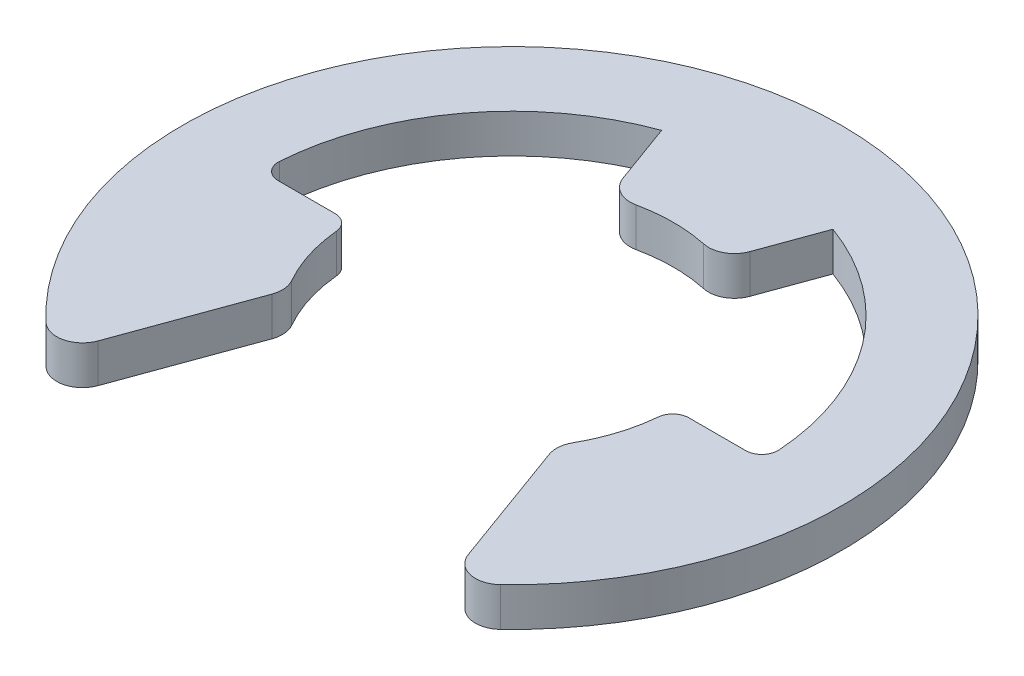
ISO-10303-21;
HEADER;
FILE_DESCRIPTION(('STEP AP214'),'2;1');
FILE_NAME('part.step','',(''),(''),'','','');
FILE_SCHEMA(('AUTOMOTIVE_DESIGN { 1 0 10303 214 1 1 1 1 }'));
ENDSEC;
DATA;
#1=APPLICATION_CONTEXT('core data for automotive mechanical design processes');
#2=APPLICATION_PROTOCOL_DEFINITION('international standard','automotive_design',2000,#1);
#3=PRODUCT_CONTEXT('',#1,'mechanical');
#4=PRODUCT('Part','Part','',(#3));
#5=PRODUCT_RELATED_PRODUCT_CATEGORY('part','',(#4));
#6=PRODUCT_DEFINITION_FORMATION('','',#4);
#7=PRODUCT_DEFINITION_CONTEXT('part definition',#1,'design');
#8=PRODUCT_DEFINITION('design','',#6,#7);
#9=PRODUCT_DEFINITION_SHAPE('','',#8);
#10=(LENGTH_UNIT() NAMED_UNIT(*) SI_UNIT(.MILLI.,.METRE.));
#11=(NAMED_UNIT(*) PLANE_ANGLE_UNIT() SI_UNIT($,.RADIAN.));
#12=(NAMED_UNIT(*) SI_UNIT($,.STERADIAN.) SOLID_ANGLE_UNIT());
#13=UNCERTAINTY_MEASURE_WITH_UNIT(LENGTH_MEASURE(1.E-05),#10,'distance_accuracy_value','');
#14=(GEOMETRIC_REPRESENTATION_CONTEXT(3) GLOBAL_UNCERTAINTY_ASSIGNED_CONTEXT((#13)) GLOBAL_UNIT_ASSIGNED_CONTEXT((#10,
#11,#12)) REPRESENTATION_CONTEXT('',''));
#15=CARTESIAN_POINT('',(0.,0.,0.));
#16=DIRECTION('',(0.,0.,1.));
#17=DIRECTION('',(1.,0.,0.));
#18=AXIS2_PLACEMENT_3D('',#15,#16,#17);
#19=CARTESIAN_POINT('',(0.,0.6,0.));
#20=DIRECTION('',(0.,-1.,0.));
#21=DIRECTION('',(0.,0.,-1.));
#22=AXIS2_PLACEMENT_3D('',#19,#20,#21);
#23=CYLINDRICAL_SURFACE('',#22,7.75);
#24=CARTESIAN_POINT('',(0.,0.6,0.));
#25=DIRECTION('',(0.,-1.,0.));
#26=DIRECTION('',(0.,0.,1.));
#27=AXIS2_PLACEMENT_3D('',#24,#25,#26);
#28=CIRCLE('',#27,7.75);
#29=CARTESIAN_POINT('',(-7.73154759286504,0.6,-0.53448275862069));
#30=VERTEX_POINT('',#29);
#31=CARTESIAN_POINT('',(-2.65065611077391,0.6,-7.2826178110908));
#32=VERTEX_POINT('',#31);
#33=EDGE_CURVE('E187',#30,#32,#28,.T.);
#34=ORIENTED_EDGE('',*,*,#33,.F.);
#35=DIRECTION('',(0.,-1.,0.));
#36=VECTOR('',#35,1.);
#37=CARTESIAN_POINT('',(-7.73154759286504,0.6,-0.53448275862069));
#38=LINE('',#37,#36);
#39=CARTESIAN_POINT('',(-7.73154759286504,-0.6,-0.53448275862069));
#40=VERTEX_POINT('',#39);
#41=EDGE_CURVE('E329',#30,#40,#38,.T.);
#42=ORIENTED_EDGE('',*,*,#41,.T.);
#43=CARTESIAN_POINT('',(0.,-0.6,0.));
#44=DIRECTION('',(0.,-1.,0.));
#45=DIRECTION('',(0.,0.,1.));
#46=AXIS2_PLACEMENT_3D('',#43,#44,#45);
#47=CIRCLE('',#46,7.75);
#48=CARTESIAN_POINT('',(-2.65065611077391,-0.6,-7.2826178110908));
#49=VERTEX_POINT('',#48);
#50=EDGE_CURVE('E211',#40,#49,#47,.T.);
#51=ORIENTED_EDGE('',*,*,#50,.T.);
#52=DIRECTION('',(0.,-1.,0.));
#53=VECTOR('',#52,1.);
#54=CARTESIAN_POINT('',(-2.65065611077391,0.6,-7.2826178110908));
#55=LINE('',#54,#53);
#56=EDGE_CURVE('E204',#32,#49,#55,.T.);
#57=ORIENTED_EDGE('',*,*,#56,.F.);
#58=EDGE_LOOP('',(#34,#42,#51,#57));
#59=FACE_BOUND('',#58,.T.);
#60=ADVANCED_FACE('F39',(#59),#23,.F.);
#61=CARTESIAN_POINT('',(-2.65065611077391,0.6,-7.2826178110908));
#62=DIRECTION('',(0.939692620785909,0.,-0.342020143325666));
#63=DIRECTION('',(-0.342020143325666,0.,-0.939692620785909));
#64=AXIS2_PLACEMENT_3D('',#61,#62,#63);
#65=PLANE('',#64);
#66=DIRECTION('',(0.342020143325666,0.,0.939692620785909));
#67=VECTOR('',#66,1.);
#68=CARTESIAN_POINT('',(-2.65065611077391,-0.6,-7.2826178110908));
#69=LINE('',#68,#67);
#70=CARTESIAN_POINT('',(-1.9647561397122,-0.6,-5.39812312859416));
#71=VERTEX_POINT('',#70);
#72=EDGE_CURVE('E448',#49,#71,#69,.T.);
#73=ORIENTED_EDGE('',*,*,#72,.T.);
#74=DIRECTION('',(0.,-1.,0.));
#75=VECTOR('',#74,1.);
#76=CARTESIAN_POINT('',(-1.9647561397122,0.6,-5.39812312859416));
#77=LINE('',#76,#75);
#78=CARTESIAN_POINT('',(-1.9647561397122,0.6,-5.39812312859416));
#79=VERTEX_POINT('',#78);
#80=EDGE_CURVE('E206',#71,#79,#77,.F.);
#81=ORIENTED_EDGE('',*,*,#80,.T.);
#82=DIRECTION('',(0.342020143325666,0.,0.939692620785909));
#83=VECTOR('',#82,1.);
#84=CARTESIAN_POINT('',(-2.65065611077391,0.6,-7.2826178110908));
#85=LINE('',#84,#83);
#86=EDGE_CURVE('E191',#32,#79,#85,.T.);
#87=ORIENTED_EDGE('',*,*,#86,.F.);
#88=ORIENTED_EDGE('',*,*,#56,.T.);
#89=EDGE_LOOP('',(#73,#81,#87,#88));
#90=FACE_BOUND('',#89,.T.);
#91=ADVANCED_FACE('F203',(#90),#65,.F.);
#92=CARTESIAN_POINT('',(0.,0.6,0.));
#93=DIRECTION('',(0.,-1.,0.));
#94=DIRECTION('',(0.,0.,-1.));
#95=AXIS2_PLACEMENT_3D('',#92,#93,#94);
#96=CYLINDRICAL_SURFACE('',#95,5.);
#97=CARTESIAN_POINT('',(0.,-0.6,0.));
#98=DIRECTION('',(0.,-1.,0.));
#99=DIRECTION('',(0.,0.,1.));
#100=AXIS2_PLACEMENT_3D('',#97,#98,#99);
#101=CIRCLE('',#100,5.);
#102=CARTESIAN_POINT('',(-1.04569141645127,-0.6,-4.88943038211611));
#103=VERTEX_POINT('',#102);
#104=CARTESIAN_POINT('',(1.04569141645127,-0.6,-4.88943038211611));
#105=VERTEX_POINT('',#104);
#106=EDGE_CURVE('E451',#103,#105,#101,.T.);
#107=ORIENTED_EDGE('',*,*,#106,.T.);
#108=DIRECTION('',(0.,-1.,0.));
#109=VECTOR('',#108,1.);
#110=CARTESIAN_POINT('',(1.04569141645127,0.6,-4.88943038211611));
#111=LINE('',#110,#109);
#112=CARTESIAN_POINT('',(1.04569141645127,0.6,-4.88943038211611));
#113=VERTEX_POINT('',#112);
#114=EDGE_CURVE('E291',#105,#113,#111,.F.);
#115=ORIENTED_EDGE('',*,*,#114,.T.);
#116=CARTESIAN_POINT('',(0.,0.6,0.));
#117=DIRECTION('',(0.,-1.,0.));
#118=DIRECTION('',(0.,0.,1.));
#119=AXIS2_PLACEMENT_3D('',#116,#117,#118);
#120=CIRCLE('',#119,5.);
#121=CARTESIAN_POINT('',(-1.04569141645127,0.6,-4.88943038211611));
#122=VERTEX_POINT('',#121);
#123=EDGE_CURVE('E208',#122,#113,#120,.T.);
#124=ORIENTED_EDGE('',*,*,#123,.F.);
#125=DIRECTION('',(0.,-1.,0.));
#126=VECTOR('',#125,1.);
#127=CARTESIAN_POINT('',(-1.04569141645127,0.6,-4.88943038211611));
#128=LINE('',#127,#126);
#129=EDGE_CURVE('E287',#122,#103,#128,.T.);
#130=ORIENTED_EDGE('',*,*,#129,.T.);
#131=EDGE_LOOP('',(#107,#115,#124,#130));
#132=FACE_BOUND('',#131,.T.);
#133=ADVANCED_FACE('F372',(#132),#96,.F.);
#134=CARTESIAN_POINT('',(1.71010071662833,0.6,-4.69846310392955));
#135=DIRECTION('',(-0.939692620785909,0.,-0.342020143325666));
#136=DIRECTION('',(-0.342020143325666,0.,0.939692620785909));
#137=AXIS2_PLACEMENT_3D('',#134,#135,#136);
#138=PLANE('',#137);
#139=DIRECTION('',(0.342020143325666,0.,-0.939692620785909));
#140=VECTOR('',#139,1.);
#141=CARTESIAN_POINT('',(1.71010071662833,0.6,-4.69846310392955));
#142=LINE('',#141,#140);
#143=CARTESIAN_POINT('',(1.9647561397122,0.6,-5.39812312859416));
#144=VERTEX_POINT('',#143);
#145=CARTESIAN_POINT('',(2.65065611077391,0.6,-7.2826178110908));
#146=VERTEX_POINT('',#145);
#147=EDGE_CURVE('E426',#144,#146,#142,.T.);
#148=ORIENTED_EDGE('',*,*,#147,.F.);
#149=DIRECTION('',(0.,-1.,0.));
#150=VECTOR('',#149,1.);
#151=CARTESIAN_POINT('',(1.9647561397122,0.6,-5.39812312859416));
#152=LINE('',#151,#150);
#153=CARTESIAN_POINT('',(1.9647561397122,-0.6,-5.39812312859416));
#154=VERTEX_POINT('',#153);
#155=EDGE_CURVE('E283',#144,#154,#152,.T.);
#156=ORIENTED_EDGE('',*,*,#155,.T.);
#157=DIRECTION('',(0.342020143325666,0.,-0.939692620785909));
#158=VECTOR('',#157,1.);
#159=CARTESIAN_POINT('',(1.71010071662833,-0.6,-4.69846310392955));
#160=LINE('',#159,#158);
#161=CARTESIAN_POINT('',(2.65065611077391,-0.6,-7.2826178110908));
#162=VERTEX_POINT('',#161);
#163=EDGE_CURVE('E455',#154,#162,#160,.T.);
#164=ORIENTED_EDGE('',*,*,#163,.T.);
#165=DIRECTION('',(0.,-1.,0.));
#166=VECTOR('',#165,1.);
#167=CARTESIAN_POINT('',(2.65065611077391,0.6,-7.2826178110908));
#168=LINE('',#167,#166);
#169=EDGE_CURVE('E215',#146,#162,#168,.T.);
#170=ORIENTED_EDGE('',*,*,#169,.F.);
#171=EDGE_LOOP('',(#148,#156,#164,#170));
#172=FACE_BOUND('',#171,.T.);
#173=ADVANCED_FACE('F527',(#172),#138,.F.);
#174=CARTESIAN_POINT('',(0.,0.6,0.));
#175=DIRECTION('',(0.,-1.,0.));
#176=DIRECTION('',(0.,0.,-1.));
#177=AXIS2_PLACEMENT_3D('',#174,#175,#176);
#178=CYLINDRICAL_SURFACE('',#177,7.75);
#179=CARTESIAN_POINT('',(0.,-0.6,0.));
#180=DIRECTION('',(0.,-1.,0.));
#181=DIRECTION('',(0.,0.,1.));
#182=AXIS2_PLACEMENT_3D('',#179,#180,#181);
#183=CIRCLE('',#182,7.75);
#184=CARTESIAN_POINT('',(7.73154759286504,-0.6,-0.53448275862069));
#185=VERTEX_POINT('',#184);
#186=EDGE_CURVE('E458',#162,#185,#183,.T.);
#187=ORIENTED_EDGE('',*,*,#186,.T.);
#188=DIRECTION('',(0.,-1.,0.));
#189=VECTOR('',#188,1.);
#190=CARTESIAN_POINT('',(7.73154759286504,0.6,-0.53448275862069));
#191=LINE('',#190,#189);
#192=CARTESIAN_POINT('',(7.73154759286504,0.6,-0.53448275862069));
#193=VERTEX_POINT('',#192);
#194=EDGE_CURVE('E310',#185,#193,#191,.F.);
#195=ORIENTED_EDGE('',*,*,#194,.T.);
#196=CARTESIAN_POINT('',(0.,0.6,0.));
#197=DIRECTION('',(0.,-1.,0.));
#198=DIRECTION('',(0.,0.,1.));
#199=AXIS2_PLACEMENT_3D('',#196,#197,#198);
#200=CIRCLE('',#199,7.75);
#201=EDGE_CURVE('E412',#146,#193,#200,.T.);
#202=ORIENTED_EDGE('',*,*,#201,.F.);
#203=ORIENTED_EDGE('',*,*,#169,.T.);
#204=EDGE_LOOP('',(#187,#195,#202,#203));
#205=FACE_BOUND('',#204,.T.);
#206=ADVANCED_FACE('F521',(#205),#178,.F.);
#207=CARTESIAN_POINT('',(5.,0.6,0.));
#208=DIRECTION('',(0.,0.,1.));
#209=DIRECTION('',(1.,0.,0.));
#210=AXIS2_PLACEMENT_3D('',#207,#208,#209);
#211=PLANE('',#210);
#212=DIRECTION('',(-1.,0.,0.));
#213=VECTOR('',#212,1.);
#214=CARTESIAN_POINT('',(5.,0.6,0.));
#215=LINE('',#214,#213);
#216=CARTESIAN_POINT('',(7.23273807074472,0.6,0.));
#217=VERTEX_POINT('',#216);
#218=CARTESIAN_POINT('',(5.47722557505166,0.6,0.));
#219=VERTEX_POINT('',#218);
#220=EDGE_CURVE('E409',#217,#219,#215,.T.);
#221=ORIENTED_EDGE('',*,*,#220,.F.);
#222=DIRECTION('',(0.,1.,0.));
#223=VECTOR('',#222,1.);
#224=CARTESIAN_POINT('',(7.23273807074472,-0.6,0.));
#225=LINE('',#224,#223);
#226=CARTESIAN_POINT('',(7.23273807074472,-0.6,0.));
#227=VERTEX_POINT('',#226);
#228=EDGE_CURVE('E306',#217,#227,#225,.F.);
#229=ORIENTED_EDGE('',*,*,#228,.T.);
#230=DIRECTION('',(-1.,0.,0.));
#231=VECTOR('',#230,1.);
#232=CARTESIAN_POINT('',(5.,-0.6,0.));
#233=LINE('',#232,#231);
#234=CARTESIAN_POINT('',(5.47722557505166,-0.6,0.));
#235=VERTEX_POINT('',#234);
#236=EDGE_CURVE('E462',#227,#235,#233,.T.);
#237=ORIENTED_EDGE('',*,*,#236,.T.);
#238=DIRECTION('',(0.,-1.,0.));
#239=VECTOR('',#238,1.);
#240=CARTESIAN_POINT('',(5.47722557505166,0.6,0.));
#241=LINE('',#240,#239);
#242=EDGE_CURVE('E303',#235,#219,#241,.F.);
#243=ORIENTED_EDGE('',*,*,#242,.T.);
#244=EDGE_LOOP('',(#221,#229,#237,#243));
#245=FACE_BOUND('',#244,.T.);
#246=ADVANCED_FACE('F414',(#245),#211,.F.);
#247=CARTESIAN_POINT('',(0.,0.6,0.));
#248=DIRECTION('',(0.,-1.,0.));
#249=DIRECTION('',(0.,0.,-1.));
#250=AXIS2_PLACEMENT_3D('',#247,#248,#249);
#251=CYLINDRICAL_SURFACE('',#250,5.);
#252=CARTESIAN_POINT('',(0.,0.6,0.));
#253=DIRECTION('',(0.,-1.,0.));
#254=DIRECTION('',(0.,0.,1.));
#255=AXIS2_PLACEMENT_3D('',#252,#253,#254);
#256=CIRCLE('',#255,5.);
#257=CARTESIAN_POINT('',(4.97929597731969,0.6,0.454545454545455));
#258=VERTEX_POINT('',#257);
#259=CARTESIAN_POINT('',(4.348203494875,0.6,2.46842588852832));
#260=VERTEX_POINT('',#259);
#261=EDGE_CURVE('E419',#258,#260,#256,.T.);
#262=ORIENTED_EDGE('',*,*,#261,.F.);
#263=DIRECTION('',(0.,-1.,0.));
#264=VECTOR('',#263,1.);
#265=CARTESIAN_POINT('',(4.97929597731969,0.6,0.454545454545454));
#266=LINE('',#265,#264);
#267=CARTESIAN_POINT('',(4.97929597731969,-0.6,0.454545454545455));
#268=VERTEX_POINT('',#267);
#269=EDGE_CURVE('E313',#258,#268,#266,.T.);
#270=ORIENTED_EDGE('',*,*,#269,.T.);
#271=CARTESIAN_POINT('',(0.,-0.6,0.));
#272=DIRECTION('',(0.,-1.,0.));
#273=DIRECTION('',(0.,0.,1.));
#274=AXIS2_PLACEMENT_3D('',#271,#272,#273);
#275=CIRCLE('',#274,5.);
#276=CARTESIAN_POINT('',(4.348203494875,-0.6,2.46842588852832));
#277=VERTEX_POINT('',#276);
#278=EDGE_CURVE('E464',#268,#277,#275,.T.);
#279=ORIENTED_EDGE('',*,*,#278,.T.);
#280=DIRECTION('',(0.,-1.,0.));
#281=VECTOR('',#280,1.);
#282=CARTESIAN_POINT('',(4.348203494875,0.6,2.46842588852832));
#283=LINE('',#282,#281);
#284=EDGE_CURVE('E250',#277,#260,#283,.F.);
#285=ORIENTED_EDGE('',*,*,#284,.T.);
#286=EDGE_LOOP('',(#262,#270,#279,#285));
#287=FACE_BOUND('',#286,.T.);
#288=ADVANCED_FACE('F512',(#287),#251,.F.);
#289=CARTESIAN_POINT('',(4.15999999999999,0.6,2.77387815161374));
#290=DIRECTION('',(0.939692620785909,0.,-0.342020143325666));
#291=DIRECTION('',(-0.342020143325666,0.,-0.939692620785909));
#292=AXIS2_PLACEMENT_3D('',#289,#290,#291);
#293=PLANE('',#292);
#294=DIRECTION('',(0.342020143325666,0.,0.939692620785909));
#295=VECTOR('',#294,1.);
#296=CARTESIAN_POINT('',(4.15999999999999,0.6,2.77387815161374));
#297=LINE('',#296,#295);
#298=CARTESIAN_POINT('',(4.29216195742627,0.6,3.13699014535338));
#299=VERTEX_POINT('',#298);
#300=CARTESIAN_POINT('',(5.72839201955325,0.6,7.0829998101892));
#301=VERTEX_POINT('',#300);
#302=EDGE_CURVE('E423',#299,#301,#297,.T.);
#303=ORIENTED_EDGE('',*,*,#302,.F.);
#304=DIRECTION('',(0.,-1.,0.));
#305=VECTOR('',#304,1.);
#306=CARTESIAN_POINT('',(4.29216195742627,0.6,3.13699014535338));
#307=LINE('',#306,#305);
#308=CARTESIAN_POINT('',(4.29216195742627,-0.6,3.13699014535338));
#309=VERTEX_POINT('',#308);
#310=EDGE_CURVE('E220',#299,#309,#307,.T.);
#311=ORIENTED_EDGE('',*,*,#310,.T.);
#312=DIRECTION('',(0.342020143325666,0.,0.939692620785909));
#313=VECTOR('',#312,1.);
#314=CARTESIAN_POINT('',(4.15999999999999,-0.6,2.77387815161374));
#315=LINE('',#314,#313);
#316=CARTESIAN_POINT('',(5.72839201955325,-0.6,7.0829998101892));
#317=VERTEX_POINT('',#316);
#318=EDGE_CURVE('E466',#309,#317,#315,.T.);
#319=ORIENTED_EDGE('',*,*,#318,.T.);
#320=DIRECTION('',(0.,-1.,0.));
#321=VECTOR('',#320,1.);
#322=CARTESIAN_POINT('',(5.72839201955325,0.6,7.0829998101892));
#323=LINE('',#322,#321);
#324=EDGE_CURVE('E214',#317,#301,#323,.F.);
#325=ORIENTED_EDGE('',*,*,#324,.T.);
#326=EDGE_LOOP('',(#303,#311,#319,#325));
#327=FACE_BOUND('',#326,.T.);
#328=ADVANCED_FACE('F506',(#327),#293,.F.);
#329=CARTESIAN_POINT('',(0.,0.6,0.));
#330=DIRECTION('',(0.,-1.,0.));
#331=DIRECTION('',(0.,0.,-1.));
#332=AXIS2_PLACEMENT_3D('',#329,#330,#331);
#333=CYLINDRICAL_SURFACE('',#332,10.2);
#334=CARTESIAN_POINT('',(0.,0.6,0.));
#335=DIRECTION('',(0.,1.,0.));
#336=DIRECTION('',(0.,0.,1.));
#337=AXIS2_PLACEMENT_3D('',#334,#335,#336);
#338=CIRCLE('',#337,10.2);
#339=CARTESIAN_POINT('',(7.03164791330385,0.6,7.3889057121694));
#340=VERTEX_POINT('',#339);
#341=CARTESIAN_POINT('',(-7.0316479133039,0.6,7.38890571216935));
#342=VERTEX_POINT('',#341);
#343=EDGE_CURVE('E433',#340,#342,#338,.T.);
#344=ORIENTED_EDGE('',*,*,#343,.F.);
#345=DIRECTION('',(0.,-1.,0.));
#346=VECTOR('',#345,1.);
#347=CARTESIAN_POINT('',(7.03164791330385,0.6,7.3889057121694));
#348=LINE('',#347,#346);
#349=CARTESIAN_POINT('',(7.03164791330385,-0.6,7.3889057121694));
#350=VERTEX_POINT('',#349);
#351=EDGE_CURVE('E299',#340,#350,#348,.T.);
#352=ORIENTED_EDGE('',*,*,#351,.T.);
#353=CARTESIAN_POINT('',(0.,-0.6,0.));
#354=DIRECTION('',(0.,1.,0.));
#355=DIRECTION('',(0.,0.,1.));
#356=AXIS2_PLACEMENT_3D('',#353,#354,#355);
#357=CIRCLE('',#356,10.2);
#358=CARTESIAN_POINT('',(-7.0316479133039,-0.6,7.38890571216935));
#359=VERTEX_POINT('',#358);
#360=EDGE_CURVE('E470',#350,#359,#357,.T.);
#361=ORIENTED_EDGE('',*,*,#360,.T.);
#362=DIRECTION('',(0.,-1.,0.));
#363=VECTOR('',#362,1.);
#364=CARTESIAN_POINT('',(-7.0316479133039,0.6,7.38890571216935));
#365=LINE('',#364,#363);
#366=EDGE_CURVE('E296',#359,#342,#365,.F.);
#367=ORIENTED_EDGE('',*,*,#366,.T.);
#368=EDGE_LOOP('',(#344,#352,#361,#367));
#369=FACE_BOUND('',#368,.T.);
#370=ADVANCED_FACE('F499',(#369),#333,.T.);
#371=CARTESIAN_POINT('',(-6.12030481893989,0.6,8.15977137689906));
#372=DIRECTION('',(-0.939692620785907,0.,-0.342020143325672));
#373=DIRECTION('',(-0.342020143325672,0.,0.939692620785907));
#374=AXIS2_PLACEMENT_3D('',#371,#372,#373);
#375=PLANE('',#374);
#376=DIRECTION('',(0.342020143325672,0.,-0.939692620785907));
#377=VECTOR('',#376,1.);
#378=CARTESIAN_POINT('',(-6.12030481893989,-0.6,8.15977137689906));
#379=LINE('',#378,#377);
#380=CARTESIAN_POINT('',(-5.7283920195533,-0.6,7.08299981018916));
#381=VERTEX_POINT('',#380);
#382=CARTESIAN_POINT('',(-4.2921619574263,-0.6,3.13699014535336));
#383=VERTEX_POINT('',#382);
#384=EDGE_CURVE('E474',#381,#383,#379,.T.);
#385=ORIENTED_EDGE('',*,*,#384,.T.);
#386=DIRECTION('',(0.,-1.,0.));
#387=VECTOR('',#386,1.);
#388=CARTESIAN_POINT('',(-4.2921619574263,0.6,3.13699014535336));
#389=LINE('',#388,#387);
#390=CARTESIAN_POINT('',(-4.2921619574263,0.6,3.13699014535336));
#391=VERTEX_POINT('',#390);
#392=EDGE_CURVE('E280',#383,#391,#389,.F.);
#393=ORIENTED_EDGE('',*,*,#392,.T.);
#394=DIRECTION('',(0.342020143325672,0.,-0.939692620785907));
#395=VECTOR('',#394,1.);
#396=CARTESIAN_POINT('',(-6.12030481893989,0.6,8.15977137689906));
#397=LINE('',#396,#395);
#398=CARTESIAN_POINT('',(-5.7283920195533,0.6,7.08299981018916));
#399=VERTEX_POINT('',#398);
#400=EDGE_CURVE('E437',#399,#391,#397,.T.);
#401=ORIENTED_EDGE('',*,*,#400,.F.);
#402=DIRECTION('',(0.,-1.,0.));
#403=VECTOR('',#402,1.);
#404=CARTESIAN_POINT('',(-5.7283920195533,0.6,7.08299981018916));
#405=LINE('',#404,#403);
#406=EDGE_CURVE('E276',#399,#381,#405,.T.);
#407=ORIENTED_EDGE('',*,*,#406,.T.);
#408=EDGE_LOOP('',(#385,#393,#401,#407));
#409=FACE_BOUND('',#408,.T.);
#410=ADVANCED_FACE('F491',(#409),#375,.F.);
#411=CARTESIAN_POINT('',(0.,0.6,0.));
#412=DIRECTION('',(0.,-1.,0.));
#413=DIRECTION('',(0.,0.,-1.));
#414=AXIS2_PLACEMENT_3D('',#411,#412,#413);
#415=CYLINDRICAL_SURFACE('',#414,5.);
#416=CARTESIAN_POINT('',(0.,-0.6,0.));
#417=DIRECTION('',(0.,-1.,0.));
#418=DIRECTION('',(0.,0.,1.));
#419=AXIS2_PLACEMENT_3D('',#416,#417,#418);
#420=CIRCLE('',#419,5.);
#421=CARTESIAN_POINT('',(-4.34820349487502,-0.6,2.46842588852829));
#422=VERTEX_POINT('',#421);
#423=CARTESIAN_POINT('',(-4.97929597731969,-0.6,0.454545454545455));
#424=VERTEX_POINT('',#423);
#425=EDGE_CURVE('E355',#422,#424,#420,.T.);
#426=ORIENTED_EDGE('',*,*,#425,.T.);
#427=DIRECTION('',(0.,-1.,0.));
#428=VECTOR('',#427,1.);
#429=CARTESIAN_POINT('',(-4.97929597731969,0.6,0.454545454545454));
#430=LINE('',#429,#428);
#431=CARTESIAN_POINT('',(-4.97929597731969,0.6,0.454545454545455));
#432=VERTEX_POINT('',#431);
#433=EDGE_CURVE('E338',#424,#432,#430,.F.);
#434=ORIENTED_EDGE('',*,*,#433,.T.);
#435=CARTESIAN_POINT('',(0.,0.6,0.));
#436=DIRECTION('',(0.,-1.,0.));
#437=DIRECTION('',(0.,0.,1.));
#438=AXIS2_PLACEMENT_3D('',#435,#436,#437);
#439=CIRCLE('',#438,5.);
#440=CARTESIAN_POINT('',(-4.34820349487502,0.6,2.46842588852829));
#441=VERTEX_POINT('',#440);
#442=EDGE_CURVE('E440',#441,#432,#439,.T.);
#443=ORIENTED_EDGE('',*,*,#442,.F.);
#444=DIRECTION('',(0.,-1.,0.));
#445=VECTOR('',#444,1.);
#446=CARTESIAN_POINT('',(-4.34820349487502,0.6,2.46842588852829));
#447=LINE('',#446,#445);
#448=EDGE_CURVE('E272',#441,#422,#447,.T.);
#449=ORIENTED_EDGE('',*,*,#448,.T.);
#450=EDGE_LOOP('',(#426,#434,#443,#449));
#451=FACE_BOUND('',#450,.T.);
#452=ADVANCED_FACE('F483',(#451),#415,.F.);
#453=CARTESIAN_POINT('',(-5.,0.6,0.));
#454=DIRECTION('',(0.,0.,1.));
#455=DIRECTION('',(1.,0.,0.));
#456=AXIS2_PLACEMENT_3D('',#453,#454,#455);
#457=PLANE('',#456);
#458=DIRECTION('',(-1.,0.,0.));
#459=VECTOR('',#458,1.);
#460=CARTESIAN_POINT('',(-5.,-0.6,0.));
#461=LINE('',#460,#459);
#462=CARTESIAN_POINT('',(-5.47722557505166,-0.6,0.));
#463=VERTEX_POINT('',#462);
#464=CARTESIAN_POINT('',(-7.23273807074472,-0.6,0.));
#465=VERTEX_POINT('',#464);
#466=EDGE_CURVE('E198',#463,#465,#461,.T.);
#467=ORIENTED_EDGE('',*,*,#466,.T.);
#468=DIRECTION('',(0.,1.,0.));
#469=VECTOR('',#468,1.);
#470=CARTESIAN_POINT('',(-7.23273807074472,0.6,0.));
#471=LINE('',#470,#469);
#472=CARTESIAN_POINT('',(-7.23273807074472,0.6,0.));
#473=VERTEX_POINT('',#472);
#474=EDGE_CURVE('E61',#465,#473,#471,.T.);
#475=ORIENTED_EDGE('',*,*,#474,.T.);
#476=DIRECTION('',(-1.,0.,0.));
#477=VECTOR('',#476,1.);
#478=CARTESIAN_POINT('',(-5.,0.6,0.));
#479=LINE('',#478,#477);
#480=CARTESIAN_POINT('',(-5.47722557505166,0.6,0.));
#481=VERTEX_POINT('',#480);
#482=EDGE_CURVE('E224',#481,#473,#479,.T.);
#483=ORIENTED_EDGE('',*,*,#482,.F.);
#484=DIRECTION('',(0.,-1.,0.));
#485=VECTOR('',#484,1.);
#486=CARTESIAN_POINT('',(-5.47722557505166,0.6,0.));
#487=LINE('',#486,#485);
#488=EDGE_CURVE('E332',#481,#463,#487,.T.);
#489=ORIENTED_EDGE('',*,*,#488,.T.);
#490=EDGE_LOOP('',(#467,#475,#483,#489));
#491=FACE_BOUND('',#490,.T.);
#492=ADVANCED_FACE('F352',(#491),#457,.F.);
#493=CARTESIAN_POINT('',(0.,0.6,0.));
#494=DIRECTION('',(0.,1.,0.));
#495=DIRECTION('',(0.,0.,1.));
#496=AXIS2_PLACEMENT_3D('',#493,#494,#495);
#497=PLANE('',#496);
#498=ORIENTED_EDGE('',*,*,#220,.T.);
#499=CARTESIAN_POINT('',(5.47722557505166,0.6,0.5));
#500=DIRECTION('',(0.,1.,0.));
#501=DIRECTION('',(0.,0.,1.));
#502=AXIS2_PLACEMENT_3D('',#499,#500,#501);
#503=CIRCLE('',#502,0.5);
#504=EDGE_CURVE('E326',#219,#258,#503,.T.);
#505=ORIENTED_EDGE('',*,*,#504,.T.);
#506=ORIENTED_EDGE('',*,*,#261,.T.);
#507=CARTESIAN_POINT('',(5.043916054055,0.6,2.86337403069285));
#508=DIRECTION('',(0.,1.,0.));
#509=DIRECTION('',(0.,0.,1.));
#510=AXIS2_PLACEMENT_3D('',#507,#508,#509);
#511=CIRCLE('',#510,0.8);
#512=EDGE_CURVE('E269',#260,#299,#511,.T.);
#513=ORIENTED_EDGE('',*,*,#512,.T.);
#514=ORIENTED_EDGE('',*,*,#302,.T.);
#515=CARTESIAN_POINT('',(6.48014611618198,0.6,6.80938369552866));
#516=DIRECTION('',(0.,1.,0.));
#517=DIRECTION('',(0.,0.,1.));
#518=AXIS2_PLACEMENT_3D('',#515,#516,#517);
#519=CIRCLE('',#518,0.8);
#520=EDGE_CURVE('E257',#301,#340,#519,.T.);
#521=ORIENTED_EDGE('',*,*,#520,.T.);
#522=ORIENTED_EDGE('',*,*,#343,.T.);
#523=CARTESIAN_POINT('',(-6.48014611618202,0.6,6.80938369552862));
#524=DIRECTION('',(0.,1.,0.));
#525=DIRECTION('',(0.,0.,1.));
#526=AXIS2_PLACEMENT_3D('',#523,#524,#525);
#527=CIRCLE('',#526,0.8);
#528=EDGE_CURVE('E254',#342,#399,#527,.T.);
#529=ORIENTED_EDGE('',*,*,#528,.T.);
#530=ORIENTED_EDGE('',*,*,#400,.T.);
#531=CARTESIAN_POINT('',(-5.04391605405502,0.6,2.86337403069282));
#532=DIRECTION('',(0.,1.,0.));
#533=DIRECTION('',(0.,0.,1.));
#534=AXIS2_PLACEMENT_3D('',#531,#532,#533);
#535=CIRCLE('',#534,0.8);
#536=EDGE_CURVE('E266',#391,#441,#535,.T.);
#537=ORIENTED_EDGE('',*,*,#536,.T.);
#538=ORIENTED_EDGE('',*,*,#442,.T.);
#539=CARTESIAN_POINT('',(-5.47722557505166,0.6,0.5));
#540=DIRECTION('',(0.,1.,0.));
#541=DIRECTION('',(0.,0.,1.));
#542=AXIS2_PLACEMENT_3D('',#539,#540,#541);
#543=CIRCLE('',#542,0.5);
#544=EDGE_CURVE('E323',#432,#481,#543,.T.);
#545=ORIENTED_EDGE('',*,*,#544,.T.);
#546=ORIENTED_EDGE('',*,*,#482,.T.);
#547=CARTESIAN_POINT('',(-7.23273807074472,0.6,-0.5));
#548=DIRECTION('',(0.,1.,0.));
#549=DIRECTION('',(0.,0.,1.));
#550=AXIS2_PLACEMENT_3D('',#547,#548,#549);
#551=CIRCLE('',#550,0.5);
#552=EDGE_CURVE('E11',#473,#30,#551,.F.);
#553=ORIENTED_EDGE('',*,*,#552,.T.);
#554=ORIENTED_EDGE('',*,*,#33,.T.);
#555=ORIENTED_EDGE('',*,*,#86,.T.);
#556=CARTESIAN_POINT('',(-1.21300204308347,0.6,-5.67173924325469));
#557=DIRECTION('',(0.,1.,0.));
#558=DIRECTION('',(0.,0.,1.));
#559=AXIS2_PLACEMENT_3D('',#556,#557,#558);
#560=CIRCLE('',#559,0.8);
#561=EDGE_CURVE('E260',#79,#122,#560,.T.);
#562=ORIENTED_EDGE('',*,*,#561,.T.);
#563=ORIENTED_EDGE('',*,*,#123,.T.);
#564=CARTESIAN_POINT('',(1.21300204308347,0.6,-5.67173924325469));
#565=DIRECTION('',(0.,1.,0.));
#566=DIRECTION('',(0.,0.,1.));
#567=AXIS2_PLACEMENT_3D('',#564,#565,#566);
#568=CIRCLE('',#567,0.8);
#569=EDGE_CURVE('E263',#113,#144,#568,.T.);
#570=ORIENTED_EDGE('',*,*,#569,.T.);
#571=ORIENTED_EDGE('',*,*,#147,.T.);
#572=ORIENTED_EDGE('',*,*,#201,.T.);
#573=CARTESIAN_POINT('',(7.23273807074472,0.6,-0.5));
#574=DIRECTION('',(0.,1.,0.));
#575=DIRECTION('',(0.,0.,1.));
#576=AXIS2_PLACEMENT_3D('',#573,#574,#575);
#577=CIRCLE('',#576,0.5);
#578=EDGE_CURVE('E344',#193,#217,#577,.F.);
#579=ORIENTED_EDGE('',*,*,#578,.T.);
#580=EDGE_LOOP('',(#498,#505,#506,#513,#514,#521,#522,#529,#530,#537,#538,#545,#546,#553,#554,
#555,#562,#563,#570,#571,#572,#579));
#581=FACE_BOUND('',#580,.T.);
#582=ADVANCED_FACE('F190',(#581),#497,.T.);
#583=CARTESIAN_POINT('',(0.,-0.6,0.));
#584=DIRECTION('',(0.,1.,0.));
#585=DIRECTION('',(0.,0.,1.));
#586=AXIS2_PLACEMENT_3D('',#583,#584,#585);
#587=PLANE('',#586);
#588=ORIENTED_EDGE('',*,*,#278,.F.);
#589=CARTESIAN_POINT('',(5.47722557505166,-0.6,0.5));
#590=DIRECTION('',(0.,1.,0.));
#591=DIRECTION('',(0.,0.,1.));
#592=AXIS2_PLACEMENT_3D('',#589,#590,#591);
#593=CIRCLE('',#592,0.5);
#594=EDGE_CURVE('E320',#268,#235,#593,.F.);
#595=ORIENTED_EDGE('',*,*,#594,.T.);
#596=ORIENTED_EDGE('',*,*,#236,.F.);
#597=CARTESIAN_POINT('',(7.23273807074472,-0.6,-0.5));
#598=DIRECTION('',(0.,1.,0.));
#599=DIRECTION('',(0.,0.,1.));
#600=AXIS2_PLACEMENT_3D('',#597,#598,#599);
#601=CIRCLE('',#600,0.5);
#602=EDGE_CURVE('E341',#227,#185,#601,.T.);
#603=ORIENTED_EDGE('',*,*,#602,.T.);
#604=ORIENTED_EDGE('',*,*,#186,.F.);
#605=ORIENTED_EDGE('',*,*,#163,.F.);
#606=CARTESIAN_POINT('',(1.21300204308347,-0.6,-5.67173924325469));
#607=DIRECTION('',(0.,1.,0.));
#608=DIRECTION('',(0.,0.,1.));
#609=AXIS2_PLACEMENT_3D('',#606,#607,#608);
#610=CIRCLE('',#609,0.8);
#611=EDGE_CURVE('E240',#154,#105,#610,.F.);
#612=ORIENTED_EDGE('',*,*,#611,.T.);
#613=ORIENTED_EDGE('',*,*,#106,.F.);
#614=CARTESIAN_POINT('',(-1.21300204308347,-0.6,-5.67173924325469));
#615=DIRECTION('',(0.,1.,0.));
#616=DIRECTION('',(0.,0.,1.));
#617=AXIS2_PLACEMENT_3D('',#614,#615,#616);
#618=CIRCLE('',#617,0.8);
#619=EDGE_CURVE('E237',#103,#71,#618,.F.);
#620=ORIENTED_EDGE('',*,*,#619,.T.);
#621=ORIENTED_EDGE('',*,*,#72,.F.);
#622=ORIENTED_EDGE('',*,*,#50,.F.);
#623=CARTESIAN_POINT('',(-7.23273807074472,-0.6,-0.5));
#624=DIRECTION('',(0.,1.,0.));
#625=DIRECTION('',(0.,0.,1.));
#626=AXIS2_PLACEMENT_3D('',#623,#624,#625);
#627=CIRCLE('',#626,0.5);
#628=EDGE_CURVE('E48',#40,#465,#627,.T.);
#629=ORIENTED_EDGE('',*,*,#628,.T.);
#630=ORIENTED_EDGE('',*,*,#466,.F.);
#631=CARTESIAN_POINT('',(-5.47722557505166,-0.6,0.5));
#632=DIRECTION('',(0.,1.,0.));
#633=DIRECTION('',(0.,0.,1.));
#634=AXIS2_PLACEMENT_3D('',#631,#632,#633);
#635=CIRCLE('',#634,0.5);
#636=EDGE_CURVE('E317',#463,#424,#635,.F.);
#637=ORIENTED_EDGE('',*,*,#636,.T.);
#638=ORIENTED_EDGE('',*,*,#425,.F.);
#639=CARTESIAN_POINT('',(-5.04391605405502,-0.6,2.86337403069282));
#640=DIRECTION('',(0.,1.,0.));
#641=DIRECTION('',(0.,0.,1.));
#642=AXIS2_PLACEMENT_3D('',#639,#640,#641);
#643=CIRCLE('',#642,0.8);
#644=EDGE_CURVE('E243',#422,#383,#643,.F.);
#645=ORIENTED_EDGE('',*,*,#644,.T.);
#646=ORIENTED_EDGE('',*,*,#384,.F.);
#647=CARTESIAN_POINT('',(-6.48014611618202,-0.6,6.80938369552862));
#648=DIRECTION('',(0.,1.,0.));
#649=DIRECTION('',(0.,0.,1.));
#650=AXIS2_PLACEMENT_3D('',#647,#648,#649);
#651=CIRCLE('',#650,0.8);
#652=EDGE_CURVE('E231',#381,#359,#651,.F.);
#653=ORIENTED_EDGE('',*,*,#652,.T.);
#654=ORIENTED_EDGE('',*,*,#360,.F.);
#655=CARTESIAN_POINT('',(6.48014611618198,-0.6,6.80938369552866));
#656=DIRECTION('',(0.,1.,0.));
#657=DIRECTION('',(0.,0.,1.));
#658=AXIS2_PLACEMENT_3D('',#655,#656,#657);
#659=CIRCLE('',#658,0.8);
#660=EDGE_CURVE('E234',#350,#317,#659,.F.);
#661=ORIENTED_EDGE('',*,*,#660,.T.);
#662=ORIENTED_EDGE('',*,*,#318,.F.);
#663=CARTESIAN_POINT('',(5.043916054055,-0.6,2.86337403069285));
#664=DIRECTION('',(0.,1.,0.));
#665=DIRECTION('',(0.,0.,1.));
#666=AXIS2_PLACEMENT_3D('',#663,#664,#665);
#667=CIRCLE('',#666,0.8);
#668=EDGE_CURVE('E246',#309,#277,#667,.F.);
#669=ORIENTED_EDGE('',*,*,#668,.T.);
#670=EDGE_LOOP('',(#588,#595,#596,#603,#604,#605,#612,#613,#620,#621,#622,#629,#630,#637,#638,
#645,#646,#653,#654,#661,#662,#669));
#671=FACE_BOUND('',#670,.T.);
#672=ADVANCED_FACE('F350',(#671),#587,.F.);
#673=CARTESIAN_POINT('',(5.043916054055,0.6,2.86337403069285));
#674=DIRECTION('',(0.,-1.,0.));
#675=DIRECTION('',(0.,0.,-1.));
#676=AXIS2_PLACEMENT_3D('',#673,#674,#675);
#677=CYLINDRICAL_SURFACE('',#676,0.8);
#678=ORIENTED_EDGE('',*,*,#512,.F.);
#679=ORIENTED_EDGE('',*,*,#284,.F.);
#680=ORIENTED_EDGE('',*,*,#668,.F.);
#681=ORIENTED_EDGE('',*,*,#310,.F.);
#682=EDGE_LOOP('',(#678,#679,#680,#681));
#683=FACE_BOUND('',#682,.T.);
#684=ADVANCED_FACE('F376',(#683),#677,.T.);
#685=CARTESIAN_POINT('',(-5.04391605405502,0.6,2.86337403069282));
#686=DIRECTION('',(0.,-1.,0.));
#687=DIRECTION('',(0.,0.,-1.));
#688=AXIS2_PLACEMENT_3D('',#685,#686,#687);
#689=CYLINDRICAL_SURFACE('',#688,0.8);
#690=ORIENTED_EDGE('',*,*,#536,.F.);
#691=ORIENTED_EDGE('',*,*,#392,.F.);
#692=ORIENTED_EDGE('',*,*,#644,.F.);
#693=ORIENTED_EDGE('',*,*,#448,.F.);
#694=EDGE_LOOP('',(#690,#691,#692,#693));
#695=FACE_BOUND('',#694,.T.);
#696=ADVANCED_FACE('F379',(#695),#689,.T.);
#697=CARTESIAN_POINT('',(1.21300204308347,0.6,-5.67173924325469));
#698=DIRECTION('',(0.,-1.,0.));
#699=DIRECTION('',(0.,0.,-1.));
#700=AXIS2_PLACEMENT_3D('',#697,#698,#699);
#701=CYLINDRICAL_SURFACE('',#700,0.8);
#702=ORIENTED_EDGE('',*,*,#569,.F.);
#703=ORIENTED_EDGE('',*,*,#114,.F.);
#704=ORIENTED_EDGE('',*,*,#611,.F.);
#705=ORIENTED_EDGE('',*,*,#155,.F.);
#706=EDGE_LOOP('',(#702,#703,#704,#705));
#707=FACE_BOUND('',#706,.T.);
#708=ADVANCED_FACE('F383',(#707),#701,.T.);
#709=CARTESIAN_POINT('',(-1.21300204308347,0.6,-5.67173924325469));
#710=DIRECTION('',(0.,-1.,0.));
#711=DIRECTION('',(0.,0.,-1.));
#712=AXIS2_PLACEMENT_3D('',#709,#710,#711);
#713=CYLINDRICAL_SURFACE('',#712,0.8);
#714=ORIENTED_EDGE('',*,*,#561,.F.);
#715=ORIENTED_EDGE('',*,*,#80,.F.);
#716=ORIENTED_EDGE('',*,*,#619,.F.);
#717=ORIENTED_EDGE('',*,*,#129,.F.);
#718=EDGE_LOOP('',(#714,#715,#716,#717));
#719=FACE_BOUND('',#718,.T.);
#720=ADVANCED_FACE('F387',(#719),#713,.T.);
#721=CARTESIAN_POINT('',(6.48014611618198,0.6,6.80938369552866));
#722=DIRECTION('',(0.,-1.,0.));
#723=DIRECTION('',(0.,0.,-1.));
#724=AXIS2_PLACEMENT_3D('',#721,#722,#723);
#725=CYLINDRICAL_SURFACE('',#724,0.8);
#726=ORIENTED_EDGE('',*,*,#520,.F.);
#727=ORIENTED_EDGE('',*,*,#324,.F.);
#728=ORIENTED_EDGE('',*,*,#660,.F.);
#729=ORIENTED_EDGE('',*,*,#351,.F.);
#730=EDGE_LOOP('',(#726,#727,#728,#729));
#731=FACE_BOUND('',#730,.T.);
#732=ADVANCED_FACE('F391',(#731),#725,.T.);
#733=CARTESIAN_POINT('',(-6.48014611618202,0.6,6.80938369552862));
#734=DIRECTION('',(0.,-1.,0.));
#735=DIRECTION('',(0.,0.,-1.));
#736=AXIS2_PLACEMENT_3D('',#733,#734,#735);
#737=CYLINDRICAL_SURFACE('',#736,0.8);
#738=ORIENTED_EDGE('',*,*,#528,.F.);
#739=ORIENTED_EDGE('',*,*,#366,.F.);
#740=ORIENTED_EDGE('',*,*,#652,.F.);
#741=ORIENTED_EDGE('',*,*,#406,.F.);
#742=EDGE_LOOP('',(#738,#739,#740,#741));
#743=FACE_BOUND('',#742,.T.);
#744=ADVANCED_FACE('F395',(#743),#737,.T.);
#745=CARTESIAN_POINT('',(7.23273807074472,0.6,-0.5));
#746=DIRECTION('',(0.,-1.,0.));
#747=DIRECTION('',(0.,0.,-1.));
#748=AXIS2_PLACEMENT_3D('',#745,#746,#747);
#749=CYLINDRICAL_SURFACE('',#748,0.5);
#750=ORIENTED_EDGE('',*,*,#578,.F.);
#751=ORIENTED_EDGE('',*,*,#194,.F.);
#752=ORIENTED_EDGE('',*,*,#602,.F.);
#753=ORIENTED_EDGE('',*,*,#228,.F.);
#754=EDGE_LOOP('',(#750,#751,#752,#753));
#755=FACE_BOUND('',#754,.T.);
#756=ADVANCED_FACE('F364',(#755),#749,.F.);
#757=CARTESIAN_POINT('',(5.47722557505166,0.6,0.5));
#758=DIRECTION('',(0.,-1.,0.));
#759=DIRECTION('',(0.,0.,-1.));
#760=AXIS2_PLACEMENT_3D('',#757,#758,#759);
#761=CYLINDRICAL_SURFACE('',#760,0.5);
#762=ORIENTED_EDGE('',*,*,#504,.F.);
#763=ORIENTED_EDGE('',*,*,#242,.F.);
#764=ORIENTED_EDGE('',*,*,#594,.F.);
#765=ORIENTED_EDGE('',*,*,#269,.F.);
#766=EDGE_LOOP('',(#762,#763,#764,#765));
#767=FACE_BOUND('',#766,.T.);
#768=ADVANCED_FACE('F358',(#767),#761,.T.);
#769=CARTESIAN_POINT('',(-7.23273807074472,0.6,-0.5));
#770=DIRECTION('',(0.,-1.,0.));
#771=DIRECTION('',(0.,0.,-1.));
#772=AXIS2_PLACEMENT_3D('',#769,#770,#771);
#773=CYLINDRICAL_SURFACE('',#772,0.5);
#774=ORIENTED_EDGE('',*,*,#552,.F.);
#775=ORIENTED_EDGE('',*,*,#474,.F.);
#776=ORIENTED_EDGE('',*,*,#628,.F.);
#777=ORIENTED_EDGE('',*,*,#41,.F.);
#778=EDGE_LOOP('',(#774,#775,#776,#777));
#779=FACE_BOUND('',#778,.T.);
#780=ADVANCED_FACE('F356',(#779),#773,.F.);
#781=CARTESIAN_POINT('',(-5.47722557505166,0.6,0.5));
#782=DIRECTION('',(0.,-1.,0.));
#783=DIRECTION('',(0.,0.,-1.));
#784=AXIS2_PLACEMENT_3D('',#781,#782,#783);
#785=CYLINDRICAL_SURFACE('',#784,0.5);
#786=ORIENTED_EDGE('',*,*,#544,.F.);
#787=ORIENTED_EDGE('',*,*,#433,.F.);
#788=ORIENTED_EDGE('',*,*,#636,.F.);
#789=ORIENTED_EDGE('',*,*,#488,.F.);
#790=EDGE_LOOP('',(#786,#787,#788,#789));
#791=FACE_BOUND('',#790,.T.);
#792=ADVANCED_FACE('F41',(#791),#785,.T.);
#793=CLOSED_SHELL('',(#60,#91,#133,#173,#206,#246,#288,#328,#370,#410,#452,#492,#582,#672,#684,
#696,#708,#720,#732,#744,#756,#768,#780,#792));
#794=MANIFOLD_SOLID_BREP('B2',#793);
#795=ADVANCED_BREP_SHAPE_REPRESENTATION('',(#18,#794),#14);
#796=SHAPE_DEFINITION_REPRESENTATION(#9,#795);
ENDSEC;
END-ISO-10303-21;
